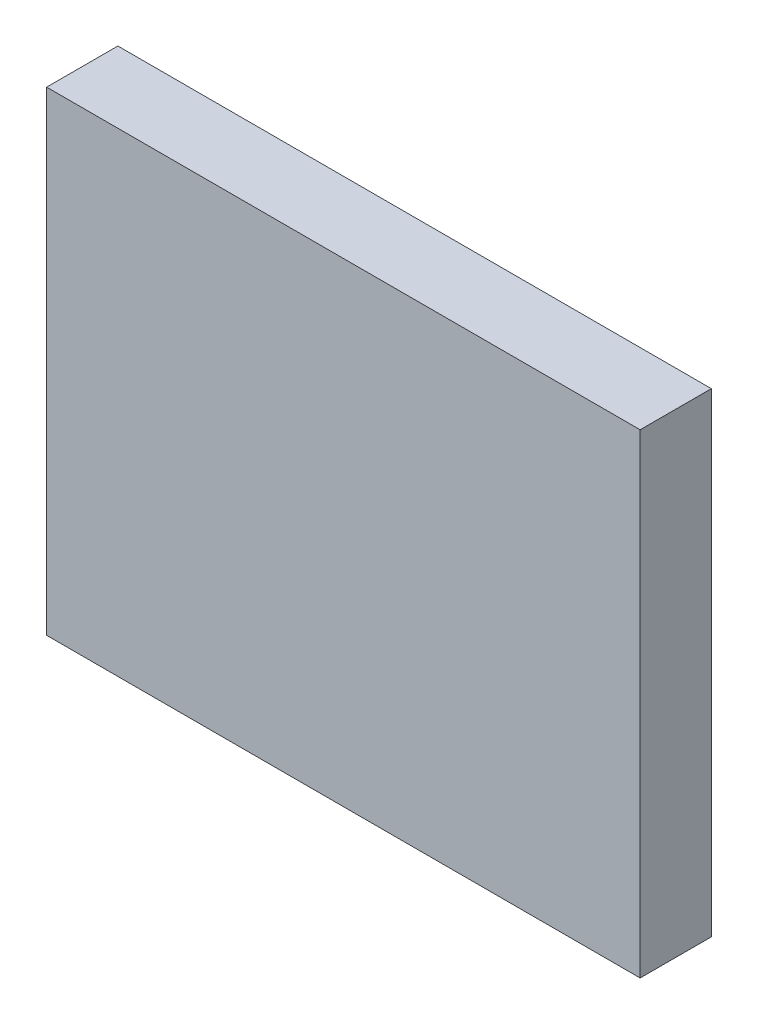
ISO-10303-21;
HEADER;
FILE_DESCRIPTION(('STEP AP214'),'2;1');
FILE_NAME('part.step','',(''),(''),'','','');
FILE_SCHEMA(('AUTOMOTIVE_DESIGN { 1 0 10303 214 1 1 1 1 }'));
ENDSEC;
DATA;
#1=APPLICATION_CONTEXT('core data for automotive mechanical design processes');
#2=APPLICATION_PROTOCOL_DEFINITION('international standard','automotive_design',2000,#1);
#3=PRODUCT_CONTEXT('',#1,'mechanical');
#4=PRODUCT('Part','Part','',(#3));
#5=PRODUCT_RELATED_PRODUCT_CATEGORY('part','',(#4));
#6=PRODUCT_DEFINITION_FORMATION('','',#4);
#7=PRODUCT_DEFINITION_CONTEXT('part definition',#1,'design');
#8=PRODUCT_DEFINITION('design','',#6,#7);
#9=PRODUCT_DEFINITION_SHAPE('','',#8);
#10=(LENGTH_UNIT() NAMED_UNIT(*) SI_UNIT(.MILLI.,.METRE.));
#11=(NAMED_UNIT(*) PLANE_ANGLE_UNIT() SI_UNIT($,.RADIAN.));
#12=(NAMED_UNIT(*) SI_UNIT($,.STERADIAN.) SOLID_ANGLE_UNIT());
#13=UNCERTAINTY_MEASURE_WITH_UNIT(LENGTH_MEASURE(1.E-05),#10,'distance_accuracy_value','');
#14=(GEOMETRIC_REPRESENTATION_CONTEXT(3) GLOBAL_UNCERTAINTY_ASSIGNED_CONTEXT((#13)) GLOBAL_UNIT_ASSIGNED_CONTEXT((#10,
#11,#12)) REPRESENTATION_CONTEXT('',''));
#15=CARTESIAN_POINT('',(0.,0.,0.));
#16=DIRECTION('',(0.,0.,1.));
#17=DIRECTION('',(1.,0.,0.));
#18=AXIS2_PLACEMENT_3D('',#15,#16,#17);
#19=CARTESIAN_POINT('',(0.,-1.33226762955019E-12,6.00000000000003));
#20=DIRECTION('',(1.,0.,0.));
#21=DIRECTION('',(0.,0.,-1.));
#22=AXIS2_PLACEMENT_3D('',#19,#20,#21);
#23=PLANE('',#22);
#24=DIRECTION('',(0.,-1.,0.));
#25=VECTOR('',#24,1.);
#26=CARTESIAN_POINT('',(1.66533453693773E-13,-1.33226762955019E-12,0.));
#27=LINE('',#26,#25);
#28=CARTESIAN_POINT('',(1.66533453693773E-13,39.9999999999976,0.));
#29=VERTEX_POINT('',#28);
#30=CARTESIAN_POINT('',(1.66533453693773E-13,-1.33226762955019E-12,0.));
#31=VERTEX_POINT('',#30);
#32=EDGE_CURVE('E85',#29,#31,#27,.T.);
#33=ORIENTED_EDGE('',*,*,#32,.T.);
#34=DIRECTION('',(0.,0.,-1.));
#35=VECTOR('',#34,1.);
#36=CARTESIAN_POINT('',(0.,-1.33226762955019E-12,6.00000000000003));
#37=LINE('',#36,#35);
#38=CARTESIAN_POINT('',(0.,-1.33226762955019E-12,6.00000000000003));
#39=VERTEX_POINT('',#38);
#40=EDGE_CURVE('E11',#39,#31,#37,.T.);
#41=ORIENTED_EDGE('',*,*,#40,.F.);
#42=DIRECTION('',(0.,-1.,0.));
#43=VECTOR('',#42,1.);
#44=CARTESIAN_POINT('',(0.,-1.33226762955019E-12,6.00000000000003));
#45=LINE('',#44,#43);
#46=CARTESIAN_POINT('',(0.,39.9999999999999,6.00000000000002));
#47=VERTEX_POINT('',#46);
#48=EDGE_CURVE('E103',#47,#39,#45,.T.);
#49=ORIENTED_EDGE('',*,*,#48,.F.);
#50=DIRECTION('',(0.,0.,-1.));
#51=VECTOR('',#50,1.);
#52=CARTESIAN_POINT('',(0.,39.9999999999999,6.00000000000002));
#53=LINE('',#52,#51);
#54=EDGE_CURVE('E97',#47,#29,#53,.T.);
#55=ORIENTED_EDGE('',*,*,#54,.T.);
#56=EDGE_LOOP('',(#33,#41,#49,#55));
#57=FACE_BOUND('',#56,.T.);
#58=ADVANCED_FACE('F41',(#57),#23,.F.);
#59=CARTESIAN_POINT('',(0.,-1.33226762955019E-12,6.00000000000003));
#60=DIRECTION('',(0.,1.,0.));
#61=DIRECTION('',(0.,0.,1.));
#62=AXIS2_PLACEMENT_3D('',#59,#60,#61);
#63=PLANE('',#62);
#64=DIRECTION('',(1.,0.,0.));
#65=VECTOR('',#64,1.);
#66=CARTESIAN_POINT('',(1.66533453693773E-13,-1.33226762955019E-12,0.));
#67=LINE('',#66,#65);
#68=CARTESIAN_POINT('',(50.,0.,0.));
#69=VERTEX_POINT('',#68);
#70=EDGE_CURVE('E81',#31,#69,#67,.T.);
#71=ORIENTED_EDGE('',*,*,#70,.T.);
#72=DIRECTION('',(0.,0.,-1.));
#73=VECTOR('',#72,1.);
#74=CARTESIAN_POINT('',(50.,0.,5.99999999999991));
#75=LINE('',#74,#73);
#76=CARTESIAN_POINT('',(50.,0.,5.99999999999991));
#77=VERTEX_POINT('',#76);
#78=EDGE_CURVE('E48',#77,#69,#75,.T.);
#79=ORIENTED_EDGE('',*,*,#78,.F.);
#80=DIRECTION('',(1.,0.,0.));
#81=VECTOR('',#80,1.);
#82=CARTESIAN_POINT('',(0.,-1.33226762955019E-12,6.00000000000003));
#83=LINE('',#82,#81);
#84=EDGE_CURVE('E93',#39,#77,#83,.T.);
#85=ORIENTED_EDGE('',*,*,#84,.F.);
#86=ORIENTED_EDGE('',*,*,#40,.T.);
#87=EDGE_LOOP('',(#71,#79,#85,#86));
#88=FACE_BOUND('',#87,.T.);
#89=ADVANCED_FACE('F92',(#88),#63,.F.);
#90=CARTESIAN_POINT('',(50.,0.,5.99999999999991));
#91=DIRECTION('',(-1.,0.,0.));
#92=DIRECTION('',(0.,0.,1.));
#93=AXIS2_PLACEMENT_3D('',#90,#91,#92);
#94=PLANE('',#93);
#95=DIRECTION('',(0.,1.,0.));
#96=VECTOR('',#95,1.);
#97=CARTESIAN_POINT('',(50.,0.,0.));
#98=LINE('',#97,#96);
#99=CARTESIAN_POINT('',(50.,39.9999999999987,0.));
#100=VERTEX_POINT('',#99);
#101=EDGE_CURVE('E86',#69,#100,#98,.T.);
#102=ORIENTED_EDGE('',*,*,#101,.T.);
#103=DIRECTION('',(0.,0.,-1.));
#104=VECTOR('',#103,1.);
#105=CARTESIAN_POINT('',(50.,40.,6.00000000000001));
#106=LINE('',#105,#104);
#107=CARTESIAN_POINT('',(50.,40.,6.00000000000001));
#108=VERTEX_POINT('',#107);
#109=EDGE_CURVE('E109',#108,#100,#106,.T.);
#110=ORIENTED_EDGE('',*,*,#109,.F.);
#111=DIRECTION('',(0.,1.,0.));
#112=VECTOR('',#111,1.);
#113=CARTESIAN_POINT('',(50.,0.,5.99999999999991));
#114=LINE('',#113,#112);
#115=EDGE_CURVE('E60',#77,#108,#114,.T.);
#116=ORIENTED_EDGE('',*,*,#115,.F.);
#117=ORIENTED_EDGE('',*,*,#78,.T.);
#118=EDGE_LOOP('',(#102,#110,#116,#117));
#119=FACE_BOUND('',#118,.T.);
#120=ADVANCED_FACE('F112',(#119),#94,.F.);
#121=CARTESIAN_POINT('',(0.,39.9999999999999,6.00000000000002));
#122=DIRECTION('',(0.,-1.,0.));
#123=DIRECTION('',(0.,0.,-1.));
#124=AXIS2_PLACEMENT_3D('',#121,#122,#123);
#125=PLANE('',#124);
#126=DIRECTION('',(-1.,0.,0.));
#127=VECTOR('',#126,1.);
#128=CARTESIAN_POINT('',(1.66533453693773E-13,39.9999999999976,0.));
#129=LINE('',#128,#127);
#130=EDGE_CURVE('E101',#100,#29,#129,.T.);
#131=ORIENTED_EDGE('',*,*,#130,.T.);
#132=ORIENTED_EDGE('',*,*,#54,.F.);
#133=DIRECTION('',(-1.,0.,0.));
#134=VECTOR('',#133,1.);
#135=CARTESIAN_POINT('',(0.,39.9999999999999,6.00000000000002));
#136=LINE('',#135,#134);
#137=EDGE_CURVE('E55',#108,#47,#136,.T.);
#138=ORIENTED_EDGE('',*,*,#137,.F.);
#139=ORIENTED_EDGE('',*,*,#109,.T.);
#140=EDGE_LOOP('',(#131,#132,#138,#139));
#141=FACE_BOUND('',#140,.T.);
#142=ADVANCED_FACE('F114',(#141),#125,.F.);
#143=CARTESIAN_POINT('',(0.,39.9999999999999,6.00000000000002));
#144=DIRECTION('',(0.,0.,-1.));
#145=DIRECTION('',(-1.,0.,0.));
#146=AXIS2_PLACEMENT_3D('',#143,#144,#145);
#147=PLANE('',#146);
#148=ORIENTED_EDGE('',*,*,#48,.T.);
#149=ORIENTED_EDGE('',*,*,#84,.T.);
#150=ORIENTED_EDGE('',*,*,#115,.T.);
#151=ORIENTED_EDGE('',*,*,#137,.T.);
#152=EDGE_LOOP('',(#148,#149,#150,#151));
#153=FACE_BOUND('',#152,.T.);
#154=ADVANCED_FACE('F115',(#153),#147,.F.);
#155=CARTESIAN_POINT('',(1.66533453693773E-13,39.9999999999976,0.));
#156=DIRECTION('',(0.,0.,-1.));
#157=DIRECTION('',(-1.,0.,0.));
#158=AXIS2_PLACEMENT_3D('',#155,#156,#157);
#159=PLANE('',#158);
#160=ORIENTED_EDGE('',*,*,#32,.F.);
#161=ORIENTED_EDGE('',*,*,#130,.F.);
#162=ORIENTED_EDGE('',*,*,#101,.F.);
#163=ORIENTED_EDGE('',*,*,#70,.F.);
#164=EDGE_LOOP('',(#160,#161,#162,#163));
#165=FACE_BOUND('',#164,.T.);
#166=ADVANCED_FACE('F82',(#165),#159,.T.);
#167=CLOSED_SHELL('',(#58,#89,#120,#142,#154,#166));
#168=MANIFOLD_SOLID_BREP('B2',#167);
#169=ADVANCED_BREP_SHAPE_REPRESENTATION('',(#18,#168),#14);
#170=SHAPE_DEFINITION_REPRESENTATION(#9,#169);
ENDSEC;
END-ISO-10303-21;
